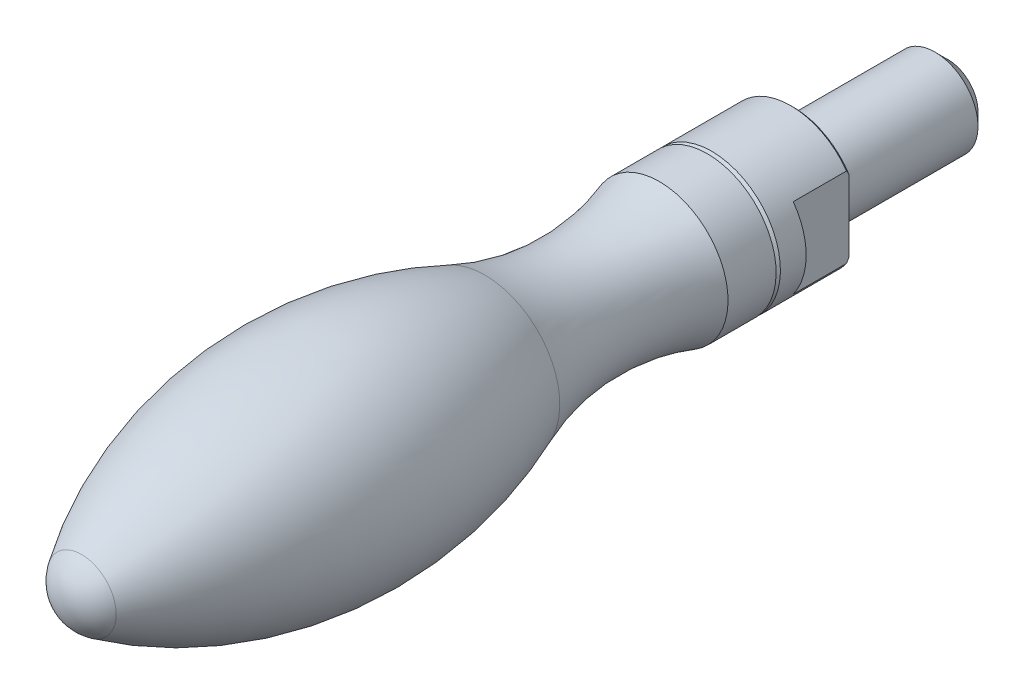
ISO-10303-21;
HEADER;
FILE_DESCRIPTION(('STEP AP214'),'2;1');
FILE_NAME('part.step','',(''),(''),'','','');
FILE_SCHEMA(('AUTOMOTIVE_DESIGN { 1 0 10303 214 1 1 1 1 }'));
ENDSEC;
DATA;
#1=APPLICATION_CONTEXT('core data for automotive mechanical design processes');
#2=APPLICATION_PROTOCOL_DEFINITION('international standard','automotive_design',2000,#1);
#3=PRODUCT_CONTEXT('',#1,'mechanical');
#4=PRODUCT('Part','Part','',(#3));
#5=PRODUCT_RELATED_PRODUCT_CATEGORY('part','',(#4));
#6=PRODUCT_DEFINITION_FORMATION('','',#4);
#7=PRODUCT_DEFINITION_CONTEXT('part definition',#1,'design');
#8=PRODUCT_DEFINITION('design','',#6,#7);
#9=PRODUCT_DEFINITION_SHAPE('','',#8);
#10=(LENGTH_UNIT() NAMED_UNIT(*) SI_UNIT(.MILLI.,.METRE.));
#11=(NAMED_UNIT(*) PLANE_ANGLE_UNIT() SI_UNIT($,.RADIAN.));
#12=(NAMED_UNIT(*) SI_UNIT($,.STERADIAN.) SOLID_ANGLE_UNIT());
#13=UNCERTAINTY_MEASURE_WITH_UNIT(LENGTH_MEASURE(1.E-05),#10,'distance_accuracy_value','');
#14=(GEOMETRIC_REPRESENTATION_CONTEXT(3) GLOBAL_UNCERTAINTY_ASSIGNED_CONTEXT((#13)) GLOBAL_UNIT_ASSIGNED_CONTEXT((#10,
#11,#12)) REPRESENTATION_CONTEXT('',''));
#15=CARTESIAN_POINT('',(0.,0.,0.));
#16=DIRECTION('',(0.,0.,1.));
#17=DIRECTION('',(1.,0.,0.));
#18=AXIS2_PLACEMENT_3D('',#15,#16,#17);
#19=CARTESIAN_POINT('',(0.,0.,89.9999999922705));
#20=DIRECTION('',(0.,0.,1.));
#21=DIRECTION('',(0.,1.,0.));
#22=AXIS2_PLACEMENT_3D('',#19,#20,#21);
#23=CYLINDRICAL_SURFACE('',#22,8.);
#24=CARTESIAN_POINT('',(0.,0.,9.49999999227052));
#25=DIRECTION('',(0.,0.,1.));
#26=DIRECTION('',(0.,1.,0.));
#27=AXIS2_PLACEMENT_3D('',#24,#25,#26);
#28=CIRCLE('',#27,8.);
#29=CARTESIAN_POINT('',(0.,8.,9.49999999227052));
#30=VERTEX_POINT('',#29);
#31=EDGE_CURVE('E110',#30,#30,#28,.T.);
#32=ORIENTED_EDGE('',*,*,#31,.F.);
#33=EDGE_LOOP('',(#32));
#34=FACE_BOUND('',#33,.T.);
#35=CARTESIAN_POINT('',(0.,0.,6.50043104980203));
#36=DIRECTION('',(0.,0.,1.));
#37=DIRECTION('',(0.,1.,0.));
#38=AXIS2_PLACEMENT_3D('',#35,#36,#37);
#39=CIRCLE('',#38,8.);
#40=CARTESIAN_POINT('',(6.5,4.66368952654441,6.50043104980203));
#41=VERTEX_POINT('',#40);
#42=CARTESIAN_POINT('',(6.5,-4.66368952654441,6.50043104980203));
#43=VERTEX_POINT('',#42);
#44=EDGE_CURVE('E82',#41,#43,#39,.F.);
#45=ORIENTED_EDGE('',*,*,#44,.F.);
#46=DIRECTION('',(0.,0.,1.));
#47=VECTOR('',#46,1.);
#48=CARTESIAN_POINT('',(6.5,4.66368952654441,89.9999999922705));
#49=LINE('',#48,#47);
#50=CARTESIAN_POINT('',(6.5,4.66368952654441,0.299999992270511));
#51=VERTEX_POINT('',#50);
#52=EDGE_CURVE('E68',#41,#51,#49,.F.);
#53=ORIENTED_EDGE('',*,*,#52,.T.);
#54=CARTESIAN_POINT('',(0.,0.,0.299999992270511));
#55=DIRECTION('',(0.,0.,1.));
#56=DIRECTION('',(0.,1.,0.));
#57=AXIS2_PLACEMENT_3D('',#54,#55,#56);
#58=CIRCLE('',#57,8.);
#59=CARTESIAN_POINT('',(-6.4999999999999,4.66368952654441,0.299999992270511));
#60=VERTEX_POINT('',#59);
#61=EDGE_CURVE('E115',#51,#60,#58,.T.);
#62=ORIENTED_EDGE('',*,*,#61,.T.);
#63=DIRECTION('',(0.,0.,1.));
#64=VECTOR('',#63,1.);
#65=CARTESIAN_POINT('',(-6.4999999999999,4.66368952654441,89.9999999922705));
#66=LINE('',#65,#64);
#67=CARTESIAN_POINT('',(-6.4999999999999,4.66368952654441,6.50043104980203));
#68=VERTEX_POINT('',#67);
#69=EDGE_CURVE('E122',#68,#60,#66,.F.);
#70=ORIENTED_EDGE('',*,*,#69,.F.);
#71=CARTESIAN_POINT('',(0.,0.,6.50043104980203));
#72=DIRECTION('',(0.,0.,-1.));
#73=DIRECTION('',(0.,-1.,0.));
#74=AXIS2_PLACEMENT_3D('',#71,#72,#73);
#75=CIRCLE('',#74,8.);
#76=CARTESIAN_POINT('',(-6.4999999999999,-4.66368952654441,6.50043104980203));
#77=VERTEX_POINT('',#76);
#78=EDGE_CURVE('E88',#68,#77,#75,.F.);
#79=ORIENTED_EDGE('',*,*,#78,.T.);
#80=DIRECTION('',(0.,0.,1.));
#81=VECTOR('',#80,1.);
#82=CARTESIAN_POINT('',(-6.4999999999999,-4.66368952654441,89.9999999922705));
#83=LINE('',#82,#81);
#84=CARTESIAN_POINT('',(-6.4999999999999,-4.66368952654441,0.299999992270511));
#85=VERTEX_POINT('',#84);
#86=EDGE_CURVE('E125',#85,#77,#83,.T.);
#87=ORIENTED_EDGE('',*,*,#86,.F.);
#88=CARTESIAN_POINT('',(6.5,-4.66368952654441,0.299999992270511));
#89=VERTEX_POINT('',#88);
#90=EDGE_CURVE('E113',#85,#89,#58,.T.);
#91=ORIENTED_EDGE('',*,*,#90,.T.);
#92=DIRECTION('',(0.,0.,1.));
#93=VECTOR('',#92,1.);
#94=CARTESIAN_POINT('',(6.5,-4.66368952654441,89.9999999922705));
#95=LINE('',#94,#93);
#96=EDGE_CURVE('E78',#89,#43,#95,.T.);
#97=ORIENTED_EDGE('',*,*,#96,.T.);
#98=EDGE_LOOP('',(#45,#53,#62,#70,#79,#87,#91,#97));
#99=FACE_BOUND('',#98,.T.);
#100=ADVANCED_FACE('F14',(#34,#99),#23,.T.);
#101=CARTESIAN_POINT('',(0.,0.,0.299999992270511));
#102=DIRECTION('',(0.,0.,1.));
#103=DIRECTION('',(0.,1.,0.));
#104=AXIS2_PLACEMENT_3D('',#101,#102,#103);
#105=CONICAL_SURFACE('',#104,8.,0.784945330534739);
#106=ORIENTED_EDGE('',*,*,#61,.F.);
#107=CARTESIAN_POINT('',(6.5,10.7453961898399,4.86253537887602));
#108=CARTESIAN_POINT('',(6.5,10.4721963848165,4.6286222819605));
#109=CARTESIAN_POINT('',(6.5,10.197860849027,4.39601612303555));
#110=CARTESIAN_POINT('',(6.5,9.64627333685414,3.93416991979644));
#111=CARTESIAN_POINT('',(6.5,9.36902074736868,3.70493060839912));
#112=CARTESIAN_POINT('',(6.5,8.80923725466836,3.24917854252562));
#113=CARTESIAN_POINT('',(6.5,8.52668363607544,3.02269361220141));
#114=CARTESIAN_POINT('',(6.5,7.9572972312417,2.57520172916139));
#115=CARTESIAN_POINT('',(6.5,7.67046481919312,2.3541943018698));
#116=CARTESIAN_POINT('',(6.5,7.10308260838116,1.92800192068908));
#117=CARTESIAN_POINT('',(6.5,6.82274311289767,1.72253798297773));
#118=CARTESIAN_POINT('',(6.5,6.25589091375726,1.32013603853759));
#119=CARTESIAN_POINT('',(6.5,5.96937703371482,1.1231996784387));
#120=CARTESIAN_POINT('',(6.5,5.38931976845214,0.741200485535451));
#121=CARTESIAN_POINT('',(6.5,5.09579157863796,0.556114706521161));
#122=CARTESIAN_POINT('',(6.5,4.4994305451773,0.201635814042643));
#123=CARTESIAN_POINT('',(6.5,4.196602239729,0.0322352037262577));
#124=CARTESIAN_POINT('',(6.5,3.75665391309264,-0.193797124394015));
#125=CARTESIAN_POINT('',(6.5,3.62411890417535,-0.259377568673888));
#126=CARTESIAN_POINT('',(6.5,3.35686118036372,-0.385934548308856));
#127=CARTESIAN_POINT('',(6.5,3.22213851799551,-0.446911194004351));
#128=CARTESIAN_POINT('',(6.5,2.95062754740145,-0.563471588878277));
#129=CARTESIAN_POINT('',(6.5,2.81384290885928,-0.619063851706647));
#130=CARTESIAN_POINT('',(6.5,2.53794350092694,-0.724188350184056));
#131=CARTESIAN_POINT('',(6.5,2.39882859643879,-0.773720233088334));
#132=CARTESIAN_POINT('',(6.5,2.1160840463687,-0.866606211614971));
#133=CARTESIAN_POINT('',(6.5,1.97241778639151,-0.909849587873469));
#134=CARTESIAN_POINT('',(6.5,1.68292272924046,-0.988282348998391));
#135=CARTESIAN_POINT('',(6.5,1.53709441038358,-1.02347348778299));
#136=CARTESIAN_POINT('',(6.5,1.24264326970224,-1.08510992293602));
#137=CARTESIAN_POINT('',(6.5,1.09400876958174,-1.11150003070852));
#138=CARTESIAN_POINT('',(6.5,0.795210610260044,-1.15453672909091));
#139=CARTESIAN_POINT('',(6.5,0.64504573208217,-1.1711748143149));
#140=CARTESIAN_POINT('',(6.5,0.494438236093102,-1.18256391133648));
#141=B_SPLINE_CURVE_WITH_KNOTS('',3,(#107,#108,#109,#110,#111,#112,#113,#114,#115,#116,#117,
#118,#119,#120,#121,#122,#123,#124,#125,#126,#127,#128,#129,#130,#131,#132,#133,#134,#135,#136,
#137,#138,#139,#140),.UNSPECIFIED.,.F.,.F.,(4,2,2,2,2,2,2,2,2,2,2,2,2,2,2,2,4),(0.,
1.07898720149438,2.1582059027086,3.24451800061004,4.33073564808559,5.3733306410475,
6.41612606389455,7.45683712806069,8.49704818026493,8.94059625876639,9.38413370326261,
9.82695797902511,10.2698080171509,10.7196976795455,11.1694892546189,11.6220505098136,
12.0750058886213),.UNSPECIFIED.);
#142=CARTESIAN_POINT('',(6.5,4.12846006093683,0.));
#143=VERTEX_POINT('',#142);
#144=EDGE_CURVE('E73',#51,#143,#141,.T.);
#145=ORIENTED_EDGE('',*,*,#144,.T.);
#146=CARTESIAN_POINT('',(0.,0.,0.));
#147=DIRECTION('',(0.,0.,1.));
#148=DIRECTION('',(0.,1.,0.));
#149=AXIS2_PLACEMENT_3D('',#146,#147,#148);
#150=CIRCLE('',#149,7.70027158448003);
#151=CARTESIAN_POINT('',(-6.4999999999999,4.12846006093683,0.));
#152=VERTEX_POINT('',#151);
#153=EDGE_CURVE('E37',#143,#152,#150,.T.);
#154=ORIENTED_EDGE('',*,*,#153,.T.);
#155=CARTESIAN_POINT('',(-6.4999999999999,10.7453961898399,4.86253537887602));
#156=CARTESIAN_POINT('',(-6.4999999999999,10.4721963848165,4.62862228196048));
#157=CARTESIAN_POINT('',(-6.4999999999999,10.197860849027,4.39601612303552));
#158=CARTESIAN_POINT('',(-6.4999999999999,9.64627333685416,3.9341699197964));
#159=CARTESIAN_POINT('',(-6.4999999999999,9.3690207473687,3.70493060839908));
#160=CARTESIAN_POINT('',(-6.4999999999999,8.80923725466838,3.24917854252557));
#161=CARTESIAN_POINT('',(-6.4999999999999,8.52668363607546,3.02269361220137));
#162=CARTESIAN_POINT('',(-6.4999999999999,7.95729723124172,2.57520172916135));
#163=CARTESIAN_POINT('',(-6.4999999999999,7.67046481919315,2.35419430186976));
#164=CARTESIAN_POINT('',(-6.4999999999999,7.1030826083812,1.92800192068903));
#165=CARTESIAN_POINT('',(-6.4999999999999,6.8227431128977,1.72253798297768));
#166=CARTESIAN_POINT('',(-6.4999999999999,6.2558909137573,1.32013603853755));
#167=CARTESIAN_POINT('',(-6.4999999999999,5.96937703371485,1.12319967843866));
#168=CARTESIAN_POINT('',(-6.4999999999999,5.38931976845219,0.741200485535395));
#169=CARTESIAN_POINT('',(-6.4999999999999,5.09579157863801,0.556114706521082));
#170=CARTESIAN_POINT('',(-6.4999999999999,4.49943054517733,0.201635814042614));
#171=CARTESIAN_POINT('',(-6.4999999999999,4.19660223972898,0.0322352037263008));
#172=CARTESIAN_POINT('',(-6.4999999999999,3.75665391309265,-0.193797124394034));
#173=CARTESIAN_POINT('',(-6.4999999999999,3.62411890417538,-0.259377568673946));
#174=CARTESIAN_POINT('',(-6.4999999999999,3.35686118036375,-0.385934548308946));
#175=CARTESIAN_POINT('',(-6.4999999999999,3.22213851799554,-0.446911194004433));
#176=CARTESIAN_POINT('',(-6.4999999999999,2.95062754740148,-0.563471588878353));
#177=CARTESIAN_POINT('',(-6.4999999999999,2.8138429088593,-0.619063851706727));
#178=CARTESIAN_POINT('',(-6.4999999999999,2.53794350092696,-0.72418835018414));
#179=CARTESIAN_POINT('',(-6.4999999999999,2.39882859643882,-0.773720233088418));
#180=CARTESIAN_POINT('',(-6.4999999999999,2.11608404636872,-0.866606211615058));
#181=CARTESIAN_POINT('',(-6.4999999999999,1.97241778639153,-0.909849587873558));
#182=CARTESIAN_POINT('',(-6.4999999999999,1.68292272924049,-0.988282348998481));
#183=CARTESIAN_POINT('',(-6.4999999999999,1.5370944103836,-1.02347348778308));
#184=CARTESIAN_POINT('',(-6.4999999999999,1.24264326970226,-1.08510992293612));
#185=CARTESIAN_POINT('',(-6.4999999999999,1.09400876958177,-1.11150003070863));
#186=CARTESIAN_POINT('',(-6.4999999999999,0.795210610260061,-1.154536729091));
#187=CARTESIAN_POINT('',(-6.4999999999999,0.645045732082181,-1.17117481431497));
#188=CARTESIAN_POINT('',(-6.4999999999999,0.494438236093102,-1.18256391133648));
#189=B_SPLINE_CURVE_WITH_KNOTS('',3,(#155,#156,#157,#158,#159,#160,#161,#162,#163,#164,#165,
#166,#167,#168,#169,#170,#171,#172,#173,#174,#175,#176,#177,#178,#179,#180,#181,#182,#183,#184,
#185,#186,#187,#188),.UNSPECIFIED.,.F.,.F.,(4,2,2,2,2,2,2,2,2,2,2,2,2,2,2,2,4),(0.,
1.07898720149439,2.15820590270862,3.24451800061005,4.33073564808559,5.3733306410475,
6.41612606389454,7.45683712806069,8.49704818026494,8.94059625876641,9.38413370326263,
9.82695797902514,10.269808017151,10.7196976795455,11.169489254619,11.6220505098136,
12.0750058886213),.UNSPECIFIED.);
#190=EDGE_CURVE('E127',#60,#152,#189,.T.);
#191=ORIENTED_EDGE('',*,*,#190,.F.);
#192=EDGE_LOOP('',(#106,#145,#154,#191));
#193=FACE_BOUND('',#192,.T.);
#194=ADVANCED_FACE('F141',(#193),#105,.T.);
#195=CARTESIAN_POINT('',(-6.4999999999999,-4.12846006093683,0.));
#196=VERTEX_POINT('',#195);
#197=CARTESIAN_POINT('',(6.5,-4.12846006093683,0.));
#198=VERTEX_POINT('',#197);
#199=EDGE_CURVE('E116',#196,#198,#150,.T.);
#200=ORIENTED_EDGE('',*,*,#199,.T.);
#201=CARTESIAN_POINT('',(6.5,-0.494438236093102,-1.18256391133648));
#202=CARTESIAN_POINT('',(6.5,-0.601151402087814,-1.17447178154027));
#203=CARTESIAN_POINT('',(6.5,-0.707645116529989,-1.16376925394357));
#204=CARTESIAN_POINT('',(6.5,-0.919981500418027,-1.13736213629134));
#205=CARTESIAN_POINT('',(6.5,-1.02582434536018,-1.12165896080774));
#206=CARTESIAN_POINT('',(6.5,-1.34167334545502,-1.06744883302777));
#207=CARTESIAN_POINT('',(6.5,-1.55048274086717,-1.02180280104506));
#208=CARTESIAN_POINT('',(6.5,-1.96124928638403,-0.914526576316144));
#209=CARTESIAN_POINT('',(6.5,-2.1632579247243,-0.85308879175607));
#210=CARTESIAN_POINT('',(6.5,-2.56263682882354,-0.716518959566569));
#211=CARTESIAN_POINT('',(6.5,-2.76000550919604,-0.641382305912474));
#212=CARTESIAN_POINT('',(6.5,-3.03414165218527,-0.52782622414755));
#213=CARTESIAN_POINT('',(6.5,-3.11290142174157,-0.494110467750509));
#214=CARTESIAN_POINT('',(6.5,-3.26964848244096,-0.424967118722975));
#215=CARTESIAN_POINT('',(6.5,-3.3476359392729,-0.389539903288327));
#216=CARTESIAN_POINT('',(6.5,-3.5031367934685,-0.316980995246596));
#217=CARTESIAN_POINT('',(6.5,-3.58064766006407,-0.279843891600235));
#218=CARTESIAN_POINT('',(6.5,-3.73494331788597,-0.204104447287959));
#219=CARTESIAN_POINT('',(6.5,-3.81172814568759,-0.165502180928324));
#220=CARTESIAN_POINT('',(6.5,-4.20769554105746,0.0379369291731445));
#221=CARTESIAN_POINT('',(6.5,-4.52122901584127,0.213840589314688));
#222=CARTESIAN_POINT('',(6.5,-5.1384192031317,0.582287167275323));
#223=CARTESIAN_POINT('',(6.5,-5.44206961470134,0.774840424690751));
#224=CARTESIAN_POINT('',(6.5,-6.04227037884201,1.17256231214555));
#225=CARTESIAN_POINT('',(6.5,-6.33879652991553,1.37776727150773));
#226=CARTESIAN_POINT('',(6.5,-6.92535180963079,1.79706022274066));
#227=CARTESIAN_POINT('',(6.5,-7.2153824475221,2.0111461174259));
#228=CARTESIAN_POINT('',(6.5,-7.78151933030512,2.43943078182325));
#229=CARTESIAN_POINT('',(6.5,-8.05778018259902,2.65342596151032));
#230=CARTESIAN_POINT('',(6.5,-8.60640453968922,3.08638838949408));
#231=CARTESIAN_POINT('',(6.5,-8.87876771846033,3.30535604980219));
#232=CARTESIAN_POINT('',(6.5,-9.41834460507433,3.74562393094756));
#233=CARTESIAN_POINT('',(6.5,-9.68558124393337,3.96689612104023));
#234=CARTESIAN_POINT('',(6.5,-10.2173635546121,4.41255066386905));
#235=CARTESIAN_POINT('',(6.5,-10.4819097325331,4.63693241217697));
#236=CARTESIAN_POINT('',(6.5,-10.7453961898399,4.86253537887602));
#237=B_SPLINE_CURVE_WITH_KNOTS('',3,(#201,#202,#203,#204,#205,#206,#207,#208,#209,#210,#211,
#212,#213,#214,#215,#216,#217,#218,#219,#220,#221,#222,#223,#224,#225,#226,#227,#228,#229,#230,
#231,#232,#233,#234,#235,#236),.UNSPECIFIED.,.F.,.F.,(4,2,2,2,2,2,2,2,2,2,2,2,2,2,2,2,2,4),(0.,
0.320989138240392,0.641887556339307,1.28223713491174,1.91512673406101,2.54822952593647,
2.805235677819,3.06218544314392,3.32001329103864,3.57782808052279,4.65548867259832,
5.73382337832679,6.81541343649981,7.89674952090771,8.94502335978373,9.99338437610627,
11.0342191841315,12.0748544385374),.UNSPECIFIED.);
#238=EDGE_CURVE('E29',#198,#89,#237,.T.);
#239=ORIENTED_EDGE('',*,*,#238,.T.);
#240=ORIENTED_EDGE('',*,*,#90,.F.);
#241=CARTESIAN_POINT('',(-6.4999999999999,-0.494438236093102,-1.18256391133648));
#242=CARTESIAN_POINT('',(-6.4999999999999,-0.601151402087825,-1.17447178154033));
#243=CARTESIAN_POINT('',(-6.4999999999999,-0.707645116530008,-1.16376925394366));
#244=CARTESIAN_POINT('',(-6.4999999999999,-0.919981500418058,-1.13736213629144));
#245=CARTESIAN_POINT('',(-6.4999999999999,-1.02582434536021,-1.12165896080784));
#246=CARTESIAN_POINT('',(-6.4999999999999,-1.34167334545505,-1.06744883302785));
#247=CARTESIAN_POINT('',(-6.4999999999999,-1.55048274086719,-1.02180280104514));
#248=CARTESIAN_POINT('',(-6.4999999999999,-1.96124928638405,-0.914526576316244));
#249=CARTESIAN_POINT('',(-6.4999999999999,-2.16325792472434,-0.853088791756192));
#250=CARTESIAN_POINT('',(-6.4999999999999,-2.56263682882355,-0.716518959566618));
#251=CARTESIAN_POINT('',(-6.4999999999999,-2.76000550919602,-0.641382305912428));
#252=CARTESIAN_POINT('',(-6.4999999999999,-3.03414165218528,-0.527826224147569));
#253=CARTESIAN_POINT('',(-6.4999999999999,-3.1129014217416,-0.49411046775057));
#254=CARTESIAN_POINT('',(-6.4999999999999,-3.269648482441,-0.424967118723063));
#255=CARTESIAN_POINT('',(-6.4999999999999,-3.34763593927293,-0.3895399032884));
#256=CARTESIAN_POINT('',(-6.4999999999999,-3.50313679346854,-0.316980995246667));
#257=CARTESIAN_POINT('',(-6.4999999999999,-3.58064766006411,-0.279843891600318));
#258=CARTESIAN_POINT('',(-6.4999999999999,-3.734943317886,-0.204104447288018));
#259=CARTESIAN_POINT('',(-6.4999999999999,-3.8117281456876,-0.165502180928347));
#260=CARTESIAN_POINT('',(-6.4999999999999,-4.20769554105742,0.0379369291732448));
#261=CARTESIAN_POINT('',(-6.4999999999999,-4.5212290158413,0.213840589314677));
#262=CARTESIAN_POINT('',(-6.4999999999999,-5.13841920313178,0.582287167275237));
#263=CARTESIAN_POINT('',(-6.4999999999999,-5.44206961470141,0.774840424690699));
#264=CARTESIAN_POINT('',(-6.4999999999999,-6.04227037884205,1.17256231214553));
#265=CARTESIAN_POINT('',(-6.4999999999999,-6.33879652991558,1.37776727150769));
#266=CARTESIAN_POINT('',(-6.4999999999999,-6.92535180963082,1.79706022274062));
#267=CARTESIAN_POINT('',(-6.4999999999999,-7.21538244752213,2.01114611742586));
#268=CARTESIAN_POINT('',(-6.4999999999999,-7.78151933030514,2.4394307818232));
#269=CARTESIAN_POINT('',(-6.4999999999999,-8.05778018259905,2.65342596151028));
#270=CARTESIAN_POINT('',(-6.4999999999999,-8.60640453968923,3.08638838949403));
#271=CARTESIAN_POINT('',(-6.4999999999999,-8.87876771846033,3.30535604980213));
#272=CARTESIAN_POINT('',(-6.4999999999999,-9.41834460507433,3.7456239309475));
#273=CARTESIAN_POINT('',(-6.4999999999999,-9.68558124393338,3.96689612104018));
#274=CARTESIAN_POINT('',(-6.4999999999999,-10.2173635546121,4.41255066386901));
#275=CARTESIAN_POINT('',(-6.4999999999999,-10.4819097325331,4.63693241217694));
#276=CARTESIAN_POINT('',(-6.4999999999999,-10.7453961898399,4.86253537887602));
#277=B_SPLINE_CURVE_WITH_KNOTS('',3,(#241,#242,#243,#244,#245,#246,#247,#248,#249,#250,#251,
#252,#253,#254,#255,#256,#257,#258,#259,#260,#261,#262,#263,#264,#265,#266,#267,#268,#269,#270,
#271,#272,#273,#274,#275,#276),.UNSPECIFIED.,.F.,.F.,(4,2,2,2,2,2,2,2,2,2,2,2,2,2,2,2,2,4),(0.,
0.320989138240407,0.641887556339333,1.28223713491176,1.91512673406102,2.54822952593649,
2.80523567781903,3.06218544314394,3.32001329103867,3.57782808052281,4.65548867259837,
5.73382337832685,6.81541343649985,7.89674952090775,8.94502335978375,9.99338437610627,
11.0342191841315,12.0748544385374),.UNSPECIFIED.);
#278=EDGE_CURVE('E135',#196,#85,#277,.T.);
#279=ORIENTED_EDGE('',*,*,#278,.F.);
#280=EDGE_LOOP('',(#200,#239,#240,#279));
#281=FACE_BOUND('',#280,.T.);
#282=ADVANCED_FACE('F165',(#281),#105,.T.);
#283=CARTESIAN_POINT('',(-7.70027158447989,0.,0.));
#284=DIRECTION('',(0.,0.,-1.));
#285=DIRECTION('',(0.,-1.,0.));
#286=AXIS2_PLACEMENT_3D('',#283,#284,#285);
#287=PLANE('',#286);
#288=CARTESIAN_POINT('',(0.,0.,0.));
#289=DIRECTION('',(0.,0.,1.));
#290=DIRECTION('',(0.,1.,0.));
#291=AXIS2_PLACEMENT_3D('',#288,#289,#290);
#292=CIRCLE('',#291,5.);
#293=CARTESIAN_POINT('',(0.,5.,0.));
#294=VERTEX_POINT('',#293);
#295=EDGE_CURVE('E119',#294,#294,#292,.T.);
#296=ORIENTED_EDGE('',*,*,#295,.T.);
#297=EDGE_LOOP('',(#296));
#298=FACE_BOUND('',#297,.T.);
#299=ORIENTED_EDGE('',*,*,#153,.F.);
#300=DIRECTION('',(0.,-1.,0.));
#301=VECTOR('',#300,1.);
#302=CARTESIAN_POINT('',(6.5,0.,0.));
#303=LINE('',#302,#301);
#304=EDGE_CURVE('E85',#143,#198,#303,.T.);
#305=ORIENTED_EDGE('',*,*,#304,.T.);
#306=ORIENTED_EDGE('',*,*,#199,.F.);
#307=DIRECTION('',(0.,-1.,0.));
#308=VECTOR('',#307,1.);
#309=CARTESIAN_POINT('',(-6.4999999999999,0.,0.));
#310=LINE('',#309,#308);
#311=EDGE_CURVE('E93',#152,#196,#310,.T.);
#312=ORIENTED_EDGE('',*,*,#311,.F.);
#313=EDGE_LOOP('',(#299,#305,#306,#312));
#314=FACE_BOUND('',#313,.T.);
#315=ADVANCED_FACE('F162',(#298,#314),#287,.T.);
#316=CARTESIAN_POINT('',(-4.99999999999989,0.,-18.));
#317=DIRECTION('',(0.,0.,-1.));
#318=DIRECTION('',(0.,-1.,0.));
#319=AXIS2_PLACEMENT_3D('',#316,#317,#318);
#320=PLANE('',#319);
#321=CARTESIAN_POINT('',(0.,0.,-18.));
#322=DIRECTION('',(0.,0.,-1.));
#323=DIRECTION('',(-1.,0.,0.));
#324=AXIS2_PLACEMENT_3D('',#321,#322,#323);
#325=CIRCLE('',#324,3.49999999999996);
#326=CARTESIAN_POINT('',(-3.49999999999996,0.,-18.));
#327=VERTEX_POINT('',#326);
#328=EDGE_CURVE('E9',#327,#327,#325,.T.);
#329=ORIENTED_EDGE('',*,*,#328,.T.);
#330=EDGE_LOOP('',(#329));
#331=FACE_BOUND('',#330,.T.);
#332=ADVANCED_FACE('F164',(#331),#320,.T.);
#333=CARTESIAN_POINT('',(0.,0.,80.150001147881));
#334=DIRECTION('',(0.,-1.,0.));
#335=DIRECTION('',(0.,0.,1.));
#336=AXIS2_PLACEMENT_3D('',#333,#334,#335);
#337=SPHERICAL_SURFACE('',#336,4.84999885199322);
#338=CARTESIAN_POINT('',(0.,0.,80.150001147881));
#339=DIRECTION('',(0.,0.,1.));
#340=DIRECTION('',(0.,1.,0.));
#341=AXIS2_PLACEMENT_3D('',#338,#339,#340);
#342=SPHERICAL_SURFACE('',#341,4.84999885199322);
#343=CARTESIAN_POINT('',(0.,0.,82.851398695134));
#344=DIRECTION('',(0.,0.,1.));
#345=DIRECTION('',(0.,1.,0.));
#346=AXIS2_PLACEMENT_3D('',#343,#344,#345);
#347=CIRCLE('',#346,4.02801938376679);
#348=CARTESIAN_POINT('',(0.,4.02801938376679,82.851398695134));
#349=VERTEX_POINT('',#348);
#350=EDGE_CURVE('E95',#349,#349,#347,.T.);
#351=ORIENTED_EDGE('',*,*,#350,.T.);
#352=EDGE_LOOP('',(#351));
#353=FACE_BOUND('',#352,.T.);
#354=ADVANCED_FACE('F173',(#353),#342,.T.);
#355=CARTESIAN_POINT('',(0.,0.,55.001932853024));
#356=DIRECTION('',(0.,0.,1.));
#357=DIRECTION('',(0.,1.,0.));
#358=AXIS2_PLACEMENT_3D('',#355,#356,#357);
#359=DEGENERATE_TOROIDAL_SURFACE('',#358,37.4979634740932,50.0000000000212,.F.);
#360=CARTESIAN_POINT('',(0.,0.,35.88747541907));
#361=DIRECTION('',(0.,0.,1.));
#362=DIRECTION('',(0.,1.,0.));
#363=AXIS2_PLACEMENT_3D('',#360,#361,#362);
#364=CIRCLE('',#363,8.70417410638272);
#365=CARTESIAN_POINT('',(0.,8.70417410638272,35.88747541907));
#366=VERTEX_POINT('',#365);
#367=EDGE_CURVE('E98',#366,#366,#364,.T.);
#368=ORIENTED_EDGE('',*,*,#367,.T.);
#369=EDGE_LOOP('',(#368));
#370=FACE_BOUND('',#369,.T.);
#371=ORIENTED_EDGE('',*,*,#350,.F.);
#372=EDGE_LOOP('',(#371));
#373=FACE_BOUND('',#372,.T.);
#374=ADVANCED_FACE('F199',(#370,#373),#359,.F.);
#375=CARTESIAN_POINT('',(0.,0.,24.8010901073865));
#376=DIRECTION('',(0.,0.,1.));
#377=DIRECTION('',(0.,1.,0.));
#378=AXIS2_PLACEMENT_3D('',#375,#376,#377);
#379=TOROIDAL_SURFACE('',#378,35.5014139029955,28.9999999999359);
#380=ORIENTED_EDGE('',*,*,#367,.F.);
#381=EDGE_LOOP('',(#380));
#382=FACE_BOUND('',#381,.T.);
#383=CARTESIAN_POINT('',(0.,0.,15.5993384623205));
#384=DIRECTION('',(0.,0.,1.));
#385=DIRECTION('',(0.,1.,0.));
#386=AXIS2_PLACEMENT_3D('',#383,#384,#385);
#387=CIRCLE('',#386,8.00000000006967);
#388=CARTESIAN_POINT('',(0.,8.00000000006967,15.5993384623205));
#389=VERTEX_POINT('',#388);
#390=EDGE_CURVE('E101',#389,#389,#387,.T.);
#391=ORIENTED_EDGE('',*,*,#390,.T.);
#392=EDGE_LOOP('',(#391));
#393=FACE_BOUND('',#392,.T.);
#394=ADVANCED_FACE('F195',(#382,#393),#379,.F.);
#395=CARTESIAN_POINT('',(0.,0.,89.9999999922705));
#396=DIRECTION('',(0.,0.,1.));
#397=DIRECTION('',(0.,1.,0.));
#398=AXIS2_PLACEMENT_3D('',#395,#396,#397);
#399=CYLINDRICAL_SURFACE('',#398,8.00000000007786);
#400=ORIENTED_EDGE('',*,*,#390,.F.);
#401=EDGE_LOOP('',(#400));
#402=FACE_BOUND('',#401,.T.);
#403=CARTESIAN_POINT('',(0.,0.,9.99999999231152));
#404=DIRECTION('',(0.,0.,1.));
#405=DIRECTION('',(0.,1.,0.));
#406=AXIS2_PLACEMENT_3D('',#403,#404,#405);
#407=CIRCLE('',#406,8.00000000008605);
#408=CARTESIAN_POINT('',(0.,8.00000000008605,9.99999999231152));
#409=VERTEX_POINT('',#408);
#410=EDGE_CURVE('E104',#409,#409,#407,.T.);
#411=ORIENTED_EDGE('',*,*,#410,.T.);
#412=EDGE_LOOP('',(#411));
#413=FACE_BOUND('',#412,.T.);
#414=ADVANCED_FACE('F191',(#402,#413),#399,.T.);
#415=CARTESIAN_POINT('',(-8.00000000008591,0.,9.99999999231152));
#416=DIRECTION('',(0.,0.,-1.));
#417=DIRECTION('',(0.,-1.,0.));
#418=AXIS2_PLACEMENT_3D('',#415,#416,#417);
#419=PLANE('',#418);
#420=CARTESIAN_POINT('',(0.,0.,9.99999999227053));
#421=DIRECTION('',(0.,0.,1.));
#422=DIRECTION('',(0.,1.,0.));
#423=AXIS2_PLACEMENT_3D('',#420,#421,#422);
#424=CIRCLE('',#423,7.5);
#425=CARTESIAN_POINT('',(0.,7.5,9.99999999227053));
#426=VERTEX_POINT('',#425);
#427=EDGE_CURVE('E107',#426,#426,#424,.T.);
#428=ORIENTED_EDGE('',*,*,#427,.T.);
#429=EDGE_LOOP('',(#428));
#430=FACE_BOUND('',#429,.T.);
#431=ORIENTED_EDGE('',*,*,#410,.F.);
#432=EDGE_LOOP('',(#431));
#433=FACE_BOUND('',#432,.T.);
#434=ADVANCED_FACE('F187',(#430,#433),#419,.T.);
#435=CARTESIAN_POINT('',(0.,0.,9.49999999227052));
#436=DIRECTION('',(0.,0.,-1.));
#437=DIRECTION('',(0.,-1.,0.));
#438=AXIS2_PLACEMENT_3D('',#435,#436,#437);
#439=CONICAL_SURFACE('',#438,8.,0.785398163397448);
#440=ORIENTED_EDGE('',*,*,#427,.F.);
#441=EDGE_LOOP('',(#440));
#442=FACE_BOUND('',#441,.T.);
#443=ORIENTED_EDGE('',*,*,#31,.T.);
#444=EDGE_LOOP('',(#443));
#445=FACE_BOUND('',#444,.T.);
#446=ADVANCED_FACE('F160',(#442,#445),#439,.T.);
#447=CARTESIAN_POINT('',(0.,0.,89.9999999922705));
#448=DIRECTION('',(0.,0.,1.));
#449=DIRECTION('',(0.,1.,0.));
#450=AXIS2_PLACEMENT_3D('',#447,#448,#449);
#451=CYLINDRICAL_SURFACE('',#450,5.);
#452=CARTESIAN_POINT('',(0.,0.,-16.5));
#453=DIRECTION('',(0.,0.,-1.));
#454=DIRECTION('',(-1.,0.,0.));
#455=AXIS2_PLACEMENT_3D('',#452,#453,#454);
#456=CIRCLE('',#455,5.);
#457=CARTESIAN_POINT('',(-5.,0.,-16.5));
#458=VERTEX_POINT('',#457);
#459=EDGE_CURVE('E22',#458,#458,#456,.F.);
#460=ORIENTED_EDGE('',*,*,#459,.T.);
#461=EDGE_LOOP('',(#460));
#462=FACE_BOUND('',#461,.T.);
#463=ORIENTED_EDGE('',*,*,#295,.F.);
#464=EDGE_LOOP('',(#463));
#465=FACE_BOUND('',#464,.T.);
#466=ADVANCED_FACE('F157',(#462,#465),#451,.T.);
#467=CARTESIAN_POINT('',(-11.2630265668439,5.,6.50043104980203));
#468=DIRECTION('',(0.,0.,-1.));
#469=DIRECTION('',(0.,-1.,0.));
#470=AXIS2_PLACEMENT_3D('',#467,#468,#469);
#471=PLANE('',#470);
#472=DIRECTION('',(0.,-1.,0.));
#473=VECTOR('',#472,1.);
#474=CARTESIAN_POINT('',(-6.4999999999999,5.,6.50043104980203));
#475=LINE('',#474,#473);
#476=EDGE_CURVE('E77',#68,#77,#475,.T.);
#477=ORIENTED_EDGE('',*,*,#476,.T.);
#478=ORIENTED_EDGE('',*,*,#78,.F.);
#479=EDGE_LOOP('',(#477,#478));
#480=FACE_BOUND('',#479,.T.);
#481=ADVANCED_FACE('F150',(#480),#471,.T.);
#482=CARTESIAN_POINT('',(-6.4999999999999,5.,-3.46389255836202));
#483=DIRECTION('',(1.,0.,0.));
#484=DIRECTION('',(0.,1.,0.));
#485=AXIS2_PLACEMENT_3D('',#482,#483,#484);
#486=PLANE('',#485);
#487=ORIENTED_EDGE('',*,*,#69,.T.);
#488=ORIENTED_EDGE('',*,*,#190,.T.);
#489=ORIENTED_EDGE('',*,*,#311,.T.);
#490=ORIENTED_EDGE('',*,*,#278,.T.);
#491=ORIENTED_EDGE('',*,*,#86,.T.);
#492=ORIENTED_EDGE('',*,*,#476,.F.);
#493=EDGE_LOOP('',(#487,#488,#489,#490,#491,#492));
#494=FACE_BOUND('',#493,.T.);
#495=ADVANCED_FACE('F145',(#494),#486,.F.);
#496=CARTESIAN_POINT('',(6.5,5.,-3.46389255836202));
#497=DIRECTION('',(1.,0.,0.));
#498=DIRECTION('',(0.,1.,0.));
#499=AXIS2_PLACEMENT_3D('',#496,#497,#498);
#500=PLANE('',#499);
#501=DIRECTION('',(0.,-1.,0.));
#502=VECTOR('',#501,1.);
#503=CARTESIAN_POINT('',(6.5,5.,6.50043104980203));
#504=LINE('',#503,#502);
#505=EDGE_CURVE('E71',#41,#43,#504,.T.);
#506=ORIENTED_EDGE('',*,*,#505,.T.);
#507=ORIENTED_EDGE('',*,*,#96,.F.);
#508=ORIENTED_EDGE('',*,*,#238,.F.);
#509=ORIENTED_EDGE('',*,*,#304,.F.);
#510=ORIENTED_EDGE('',*,*,#144,.F.);
#511=ORIENTED_EDGE('',*,*,#52,.F.);
#512=EDGE_LOOP('',(#506,#507,#508,#509,#510,#511));
#513=FACE_BOUND('',#512,.T.);
#514=ADVANCED_FACE('F70',(#513),#500,.T.);
#515=CARTESIAN_POINT('',(11.2630265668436,5.,6.50043104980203));
#516=DIRECTION('',(0.,0.,1.));
#517=DIRECTION('',(0.,1.,0.));
#518=AXIS2_PLACEMENT_3D('',#515,#516,#517);
#519=PLANE('',#518);
#520=ORIENTED_EDGE('',*,*,#44,.T.);
#521=ORIENTED_EDGE('',*,*,#505,.F.);
#522=EDGE_LOOP('',(#520,#521));
#523=FACE_BOUND('',#522,.T.);
#524=ADVANCED_FACE('F81',(#523),#519,.F.);
#525=CARTESIAN_POINT('',(0.,0.,-16.5));
#526=DIRECTION('',(0.,0.,1.));
#527=DIRECTION('',(1.,0.,0.));
#528=AXIS2_PLACEMENT_3D('',#525,#526,#527);
#529=CONICAL_SURFACE('',#528,5.,0.785398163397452);
#530=ORIENTED_EDGE('',*,*,#328,.F.);
#531=EDGE_LOOP('',(#530));
#532=FACE_BOUND('',#531,.T.);
#533=ORIENTED_EDGE('',*,*,#459,.F.);
#534=EDGE_LOOP('',(#533));
#535=FACE_BOUND('',#534,.T.);
#536=ADVANCED_FACE('F16',(#532,#535),#529,.T.);
#537=CLOSED_SHELL('',(#100,#194,#282,#315,#332,#354,#374,#394,#414,#434,#446,#466,#481,#495,
#514,#524,#536));
#538=MANIFOLD_SOLID_BREP('B1',#537);
#539=ADVANCED_BREP_SHAPE_REPRESENTATION('',(#18,#538),#14);
#540=SHAPE_DEFINITION_REPRESENTATION(#9,#539);
ENDSEC;
END-ISO-10303-21;
